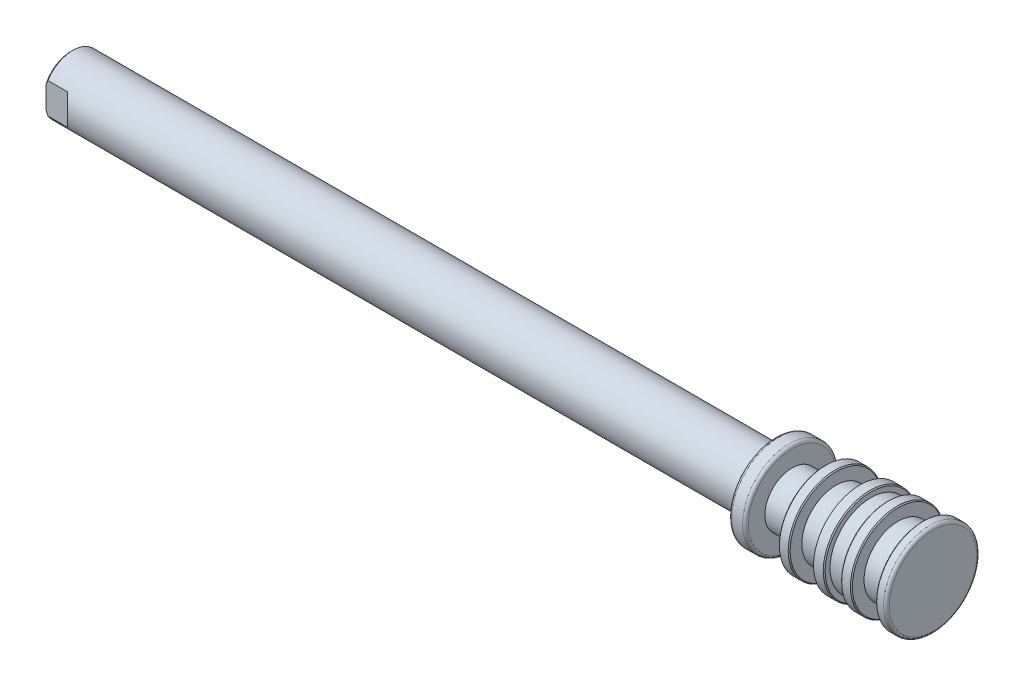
ISO-10303-21;
HEADER;
FILE_DESCRIPTION(('STEP AP214'),'2;1');
FILE_NAME('part.step','',(''),(''),'','','');
FILE_SCHEMA(('AUTOMOTIVE_DESIGN { 1 0 10303 214 1 1 1 1 }'));
ENDSEC;
DATA;
#1=APPLICATION_CONTEXT('core data for automotive mechanical design processes');
#2=APPLICATION_PROTOCOL_DEFINITION('international standard','automotive_design',2000,#1);
#3=PRODUCT_CONTEXT('',#1,'mechanical');
#4=PRODUCT('Part','Part','',(#3));
#5=PRODUCT_RELATED_PRODUCT_CATEGORY('part','',(#4));
#6=PRODUCT_DEFINITION_FORMATION('','',#4);
#7=PRODUCT_DEFINITION_CONTEXT('part definition',#1,'design');
#8=PRODUCT_DEFINITION('design','',#6,#7);
#9=PRODUCT_DEFINITION_SHAPE('','',#8);
#10=(LENGTH_UNIT() NAMED_UNIT(*) SI_UNIT(.MILLI.,.METRE.));
#11=(NAMED_UNIT(*) PLANE_ANGLE_UNIT() SI_UNIT($,.RADIAN.));
#12=(NAMED_UNIT(*) SI_UNIT($,.STERADIAN.) SOLID_ANGLE_UNIT());
#13=UNCERTAINTY_MEASURE_WITH_UNIT(LENGTH_MEASURE(1.E-05),#10,'distance_accuracy_value','');
#14=(GEOMETRIC_REPRESENTATION_CONTEXT(3) GLOBAL_UNCERTAINTY_ASSIGNED_CONTEXT((#13)) GLOBAL_UNIT_ASSIGNED_CONTEXT((#10,
#11,#12)) REPRESENTATION_CONTEXT('',''));
#15=CARTESIAN_POINT('',(0.,0.,0.));
#16=DIRECTION('',(0.,0.,1.));
#17=DIRECTION('',(1.,0.,0.));
#18=AXIS2_PLACEMENT_3D('',#15,#16,#17);
#19=CARTESIAN_POINT('',(88.7,4.5,0.));
#20=DIRECTION('',(-1.,0.,0.));
#21=DIRECTION('',(0.,0.,1.));
#22=AXIS2_PLACEMENT_3D('',#19,#20,#21);
#23=PLANE('',#22);
#24=CARTESIAN_POINT('',(88.7,0.,0.));
#25=DIRECTION('',(-1.,0.,0.));
#26=DIRECTION('',(0.,0.,-1.));
#27=AXIS2_PLACEMENT_3D('',#24,#25,#26);
#28=CIRCLE('',#27,4.5);
#29=CARTESIAN_POINT('',(88.7,0.,-4.5));
#30=VERTEX_POINT('',#29);
#31=CARTESIAN_POINT('',(88.7,0.,4.5));
#32=VERTEX_POINT('',#31);
#33=EDGE_CURVE('E288',#30,#32,#28,.T.);
#34=ORIENTED_EDGE('',*,*,#33,.F.);
#35=CARTESIAN_POINT('',(88.7,0.,0.));
#36=DIRECTION('',(-1.,0.,0.));
#37=DIRECTION('',(0.,0.,1.));
#38=AXIS2_PLACEMENT_3D('',#35,#36,#37);
#39=CIRCLE('',#38,4.5);
#40=EDGE_CURVE('E728',#32,#30,#39,.T.);
#41=ORIENTED_EDGE('',*,*,#40,.F.);
#42=EDGE_LOOP('',(#34,#41));
#43=FACE_BOUND('',#42,.T.);
#44=ADVANCED_FACE('F17',(#43),#23,.F.);
#45=CARTESIAN_POINT('',(88.4,0.,0.));
#46=DIRECTION('',(-1.,0.,0.));
#47=DIRECTION('',(0.,0.,1.));
#48=AXIS2_PLACEMENT_3D('',#45,#46,#47);
#49=TOROIDAL_SURFACE('',#48,4.50000000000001,0.299999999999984);
#50=ORIENTED_EDGE('',*,*,#40,.T.);
#51=ORIENTED_EDGE('',*,*,#33,.T.);
#52=EDGE_LOOP('',(#50,#51));
#53=FACE_BOUND('',#52,.T.);
#54=CARTESIAN_POINT('',(88.4,0.,0.));
#55=DIRECTION('',(-1.,0.,0.));
#56=DIRECTION('',(0.,0.,1.));
#57=AXIS2_PLACEMENT_3D('',#54,#55,#56);
#58=CIRCLE('',#57,4.8);
#59=CARTESIAN_POINT('',(88.4,0.,4.8));
#60=VERTEX_POINT('',#59);
#61=EDGE_CURVE('E285',#60,#60,#58,.T.);
#62=ORIENTED_EDGE('',*,*,#61,.F.);
#63=EDGE_LOOP('',(#62));
#64=FACE_BOUND('',#63,.T.);
#65=ADVANCED_FACE('F293',(#53,#64),#49,.T.);
#66=CARTESIAN_POINT('',(88.7,0.,0.));
#67=DIRECTION('',(-1.,0.,0.));
#68=DIRECTION('',(0.,0.,1.));
#69=AXIS2_PLACEMENT_3D('',#66,#67,#68);
#70=CYLINDRICAL_SURFACE('',#69,4.8);
#71=ORIENTED_EDGE('',*,*,#61,.T.);
#72=EDGE_LOOP('',(#71));
#73=FACE_BOUND('',#72,.T.);
#74=CARTESIAN_POINT('',(87.6999999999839,0.,0.));
#75=DIRECTION('',(1.,0.,0.));
#76=DIRECTION('',(0.,0.,-1.));
#77=AXIS2_PLACEMENT_3D('',#74,#75,#76);
#78=CIRCLE('',#77,4.79999999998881);
#79=CARTESIAN_POINT('',(87.6999999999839,0.,-4.79999999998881));
#80=VERTEX_POINT('',#79);
#81=EDGE_CURVE('E281',#80,#80,#78,.F.);
#82=ORIENTED_EDGE('',*,*,#81,.F.);
#83=EDGE_LOOP('',(#82));
#84=FACE_BOUND('',#83,.T.);
#85=ADVANCED_FACE('F297',(#73,#84),#70,.T.);
#86=CARTESIAN_POINT('',(87.6999999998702,0.,0.));
#87=DIRECTION('',(1.,0.,0.));
#88=DIRECTION('',(0.,0.,-1.));
#89=AXIS2_PLACEMENT_3D('',#86,#87,#88);
#90=CONICAL_SURFACE('',#89,4.79999999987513,0.785398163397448);
#91=CARTESIAN_POINT('',(87.5999999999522,0.,0.));
#92=DIRECTION('',(1.,0.,0.));
#93=DIRECTION('',(0.,0.,-1.));
#94=AXIS2_PLACEMENT_3D('',#91,#92,#93);
#95=CIRCLE('',#94,4.69999999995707);
#96=CARTESIAN_POINT('',(87.5999999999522,0.,-4.69999999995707));
#97=VERTEX_POINT('',#96);
#98=EDGE_CURVE('E284',#97,#97,#95,.T.);
#99=ORIENTED_EDGE('',*,*,#98,.T.);
#100=EDGE_LOOP('',(#99));
#101=FACE_BOUND('',#100,.T.);
#102=ORIENTED_EDGE('',*,*,#81,.T.);
#103=EDGE_LOOP('',(#102));
#104=FACE_BOUND('',#103,.T.);
#105=ADVANCED_FACE('F384',(#101,#104),#90,.T.);
#106=CARTESIAN_POINT('',(87.6,3.5,0.));
#107=DIRECTION('',(1.,0.,0.));
#108=DIRECTION('',(0.,0.,-1.));
#109=AXIS2_PLACEMENT_3D('',#106,#107,#108);
#110=PLANE('',#109);
#111=ORIENTED_EDGE('',*,*,#98,.F.);
#112=EDGE_LOOP('',(#111));
#113=FACE_BOUND('',#112,.T.);
#114=CARTESIAN_POINT('',(87.6,0.,0.));
#115=DIRECTION('',(-1.,0.,0.));
#116=DIRECTION('',(0.,0.,1.));
#117=AXIS2_PLACEMENT_3D('',#114,#115,#116);
#118=CIRCLE('',#117,3.5);
#119=CARTESIAN_POINT('',(87.6,0.,3.5));
#120=VERTEX_POINT('',#119);
#121=EDGE_CURVE('E379',#120,#120,#118,.T.);
#122=ORIENTED_EDGE('',*,*,#121,.F.);
#123=EDGE_LOOP('',(#122));
#124=FACE_BOUND('',#123,.T.);
#125=ADVANCED_FACE('F387',(#113,#124),#110,.F.);
#126=CARTESIAN_POINT('',(88.7,0.,0.));
#127=DIRECTION('',(-1.,0.,0.));
#128=DIRECTION('',(0.,0.,1.));
#129=AXIS2_PLACEMENT_3D('',#126,#127,#128);
#130=CYLINDRICAL_SURFACE('',#129,3.5);
#131=CARTESIAN_POINT('',(85.1,0.,0.));
#132=DIRECTION('',(-1.,0.,0.));
#133=DIRECTION('',(0.,0.,1.));
#134=AXIS2_PLACEMENT_3D('',#131,#132,#133);
#135=CIRCLE('',#134,3.5);
#136=CARTESIAN_POINT('',(85.1,0.,3.5));
#137=VERTEX_POINT('',#136);
#138=EDGE_CURVE('E376',#137,#137,#135,.F.);
#139=ORIENTED_EDGE('',*,*,#138,.T.);
#140=EDGE_LOOP('',(#139));
#141=FACE_BOUND('',#140,.T.);
#142=ORIENTED_EDGE('',*,*,#121,.T.);
#143=EDGE_LOOP('',(#142));
#144=FACE_BOUND('',#143,.T.);
#145=ADVANCED_FACE('F390',(#141,#144),#130,.T.);
#146=CARTESIAN_POINT('',(85.1,4.7,0.));
#147=DIRECTION('',(-1.,0.,0.));
#148=DIRECTION('',(0.,0.,1.));
#149=AXIS2_PLACEMENT_3D('',#146,#147,#148);
#150=PLANE('',#149);
#151=ORIENTED_EDGE('',*,*,#138,.F.);
#152=EDGE_LOOP('',(#151));
#153=FACE_BOUND('',#152,.T.);
#154=CARTESIAN_POINT('',(85.0999999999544,0.,0.));
#155=DIRECTION('',(-1.,0.,0.));
#156=DIRECTION('',(0.,0.,1.));
#157=AXIS2_PLACEMENT_3D('',#154,#155,#156);
#158=CIRCLE('',#157,4.70000000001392);
#159=CARTESIAN_POINT('',(85.0999999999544,0.,4.70000000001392));
#160=VERTEX_POINT('',#159);
#161=EDGE_CURVE('E280',#160,#160,#158,.T.);
#162=ORIENTED_EDGE('',*,*,#161,.F.);
#163=EDGE_LOOP('',(#162));
#164=FACE_BOUND('',#163,.T.);
#165=ADVANCED_FACE('F395',(#153,#164),#150,.F.);
#166=CARTESIAN_POINT('',(85.0000000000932,0.,0.));
#167=DIRECTION('',(-1.,0.,0.));
#168=DIRECTION('',(0.,0.,1.));
#169=AXIS2_PLACEMENT_3D('',#166,#167,#168);
#170=CONICAL_SURFACE('',#169,4.79999999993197,0.785398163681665);
#171=ORIENTED_EDGE('',*,*,#161,.T.);
#172=EDGE_LOOP('',(#171));
#173=FACE_BOUND('',#172,.T.);
#174=CARTESIAN_POINT('',(85.,0.,0.));
#175=DIRECTION('',(-1.,0.,0.));
#176=DIRECTION('',(0.,0.,1.));
#177=AXIS2_PLACEMENT_3D('',#174,#175,#176);
#178=CIRCLE('',#177,4.8);
#179=CARTESIAN_POINT('',(85.,0.,4.8));
#180=VERTEX_POINT('',#179);
#181=EDGE_CURVE('E277',#180,#180,#178,.T.);
#182=ORIENTED_EDGE('',*,*,#181,.F.);
#183=EDGE_LOOP('',(#182));
#184=FACE_BOUND('',#183,.T.);
#185=ADVANCED_FACE('F402',(#173,#184),#170,.T.);
#186=CARTESIAN_POINT('',(88.7,0.,0.));
#187=DIRECTION('',(-1.,0.,0.));
#188=DIRECTION('',(0.,0.,1.));
#189=AXIS2_PLACEMENT_3D('',#186,#187,#188);
#190=CYLINDRICAL_SURFACE('',#189,4.8);
#191=ORIENTED_EDGE('',*,*,#181,.T.);
#192=EDGE_LOOP('',(#191));
#193=FACE_BOUND('',#192,.T.);
#194=CARTESIAN_POINT('',(84.0999999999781,0.,0.));
#195=DIRECTION('',(1.,0.,0.));
#196=DIRECTION('',(0.,0.,-1.));
#197=AXIS2_PLACEMENT_3D('',#194,#195,#196);
#198=CIRCLE('',#197,4.80000000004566);
#199=CARTESIAN_POINT('',(84.0999999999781,0.,-4.80000000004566));
#200=VERTEX_POINT('',#199);
#201=EDGE_CURVE('E273',#200,#200,#198,.F.);
#202=ORIENTED_EDGE('',*,*,#201,.F.);
#203=EDGE_LOOP('',(#202));
#204=FACE_BOUND('',#203,.T.);
#205=ADVANCED_FACE('F663',(#193,#204),#190,.T.);
#206=CARTESIAN_POINT('',(84.0999999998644,0.,0.));
#207=DIRECTION('',(1.,0.,0.));
#208=DIRECTION('',(0.,0.,-1.));
#209=AXIS2_PLACEMENT_3D('',#206,#207,#208);
#210=CONICAL_SURFACE('',#209,4.79999999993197,0.785398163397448);
#211=CARTESIAN_POINT('',(84.0000000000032,0.,0.));
#212=DIRECTION('',(1.,0.,0.));
#213=DIRECTION('',(0.,0.,-1.));
#214=AXIS2_PLACEMENT_3D('',#211,#212,#213);
#215=CIRCLE('',#214,4.70000000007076);
#216=CARTESIAN_POINT('',(84.0000000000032,0.,-4.70000000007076));
#217=VERTEX_POINT('',#216);
#218=EDGE_CURVE('E276',#217,#217,#215,.T.);
#219=ORIENTED_EDGE('',*,*,#218,.T.);
#220=EDGE_LOOP('',(#219));
#221=FACE_BOUND('',#220,.T.);
#222=ORIENTED_EDGE('',*,*,#201,.T.);
#223=EDGE_LOOP('',(#222));
#224=FACE_BOUND('',#223,.T.);
#225=ADVANCED_FACE('F654',(#221,#224),#210,.T.);
#226=CARTESIAN_POINT('',(84.,4.2,0.));
#227=DIRECTION('',(1.,0.,0.));
#228=DIRECTION('',(0.,0.,-1.));
#229=AXIS2_PLACEMENT_3D('',#226,#227,#228);
#230=PLANE('',#229);
#231=ORIENTED_EDGE('',*,*,#218,.F.);
#232=EDGE_LOOP('',(#231));
#233=FACE_BOUND('',#232,.T.);
#234=CARTESIAN_POINT('',(84.,0.,0.));
#235=DIRECTION('',(-1.,0.,0.));
#236=DIRECTION('',(0.,0.,1.));
#237=AXIS2_PLACEMENT_3D('',#234,#235,#236);
#238=CIRCLE('',#237,4.2);
#239=CARTESIAN_POINT('',(84.,0.,4.2));
#240=VERTEX_POINT('',#239);
#241=EDGE_CURVE('E369',#240,#240,#238,.T.);
#242=ORIENTED_EDGE('',*,*,#241,.F.);
#243=EDGE_LOOP('',(#242));
#244=FACE_BOUND('',#243,.T.);
#245=ADVANCED_FACE('F645',(#233,#244),#230,.F.);
#246=CARTESIAN_POINT('',(88.7,0.,0.));
#247=DIRECTION('',(-1.,0.,0.));
#248=DIRECTION('',(0.,0.,1.));
#249=AXIS2_PLACEMENT_3D('',#246,#247,#248);
#250=CYLINDRICAL_SURFACE('',#249,4.2);
#251=CARTESIAN_POINT('',(82.3,0.,0.));
#252=DIRECTION('',(-1.,0.,0.));
#253=DIRECTION('',(0.,0.,1.));
#254=AXIS2_PLACEMENT_3D('',#251,#252,#253);
#255=CIRCLE('',#254,4.2);
#256=CARTESIAN_POINT('',(82.3,0.,4.2));
#257=VERTEX_POINT('',#256);
#258=EDGE_CURVE('E366',#257,#257,#255,.F.);
#259=ORIENTED_EDGE('',*,*,#258,.T.);
#260=EDGE_LOOP('',(#259));
#261=FACE_BOUND('',#260,.T.);
#262=ORIENTED_EDGE('',*,*,#241,.T.);
#263=EDGE_LOOP('',(#262));
#264=FACE_BOUND('',#263,.T.);
#265=ADVANCED_FACE('F636',(#261,#264),#250,.T.);
#266=CARTESIAN_POINT('',(82.3,4.7,0.));
#267=DIRECTION('',(-1.,0.,0.));
#268=DIRECTION('',(0.,0.,1.));
#269=AXIS2_PLACEMENT_3D('',#266,#267,#268);
#270=PLANE('',#269);
#271=ORIENTED_EDGE('',*,*,#258,.F.);
#272=EDGE_LOOP('',(#271));
#273=FACE_BOUND('',#272,.T.);
#274=CARTESIAN_POINT('',(82.2999999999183,0.,0.));
#275=DIRECTION('',(-1.,0.,0.));
#276=DIRECTION('',(0.,0.,1.));
#277=AXIS2_PLACEMENT_3D('',#274,#275,#276);
#278=CIRCLE('',#277,4.70000000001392);
#279=CARTESIAN_POINT('',(82.2999999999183,0.,4.70000000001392));
#280=VERTEX_POINT('',#279);
#281=EDGE_CURVE('E272',#280,#280,#278,.T.);
#282=ORIENTED_EDGE('',*,*,#281,.F.);
#283=EDGE_LOOP('',(#282));
#284=FACE_BOUND('',#283,.T.);
#285=ADVANCED_FACE('F627',(#273,#284),#270,.F.);
#286=CARTESIAN_POINT('',(82.200000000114,0.,0.));
#287=DIRECTION('',(-1.,0.,0.));
#288=DIRECTION('',(0.,0.,1.));
#289=AXIS2_PLACEMENT_3D('',#286,#287,#288);
#290=CONICAL_SURFACE('',#289,4.79999999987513,0.785398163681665);
#291=CARTESIAN_POINT('',(82.2,0.,0.));
#292=DIRECTION('',(-1.,0.,0.));
#293=DIRECTION('',(0.,0.,1.));
#294=AXIS2_PLACEMENT_3D('',#291,#292,#293);
#295=CIRCLE('',#294,4.8);
#296=CARTESIAN_POINT('',(82.2,0.,4.8));
#297=VERTEX_POINT('',#296);
#298=EDGE_CURVE('E268',#297,#297,#295,.T.);
#299=ORIENTED_EDGE('',*,*,#298,.F.);
#300=EDGE_LOOP('',(#299));
#301=FACE_BOUND('',#300,.T.);
#302=ORIENTED_EDGE('',*,*,#281,.T.);
#303=EDGE_LOOP('',(#302));
#304=FACE_BOUND('',#303,.T.);
#305=ADVANCED_FACE('F618',(#301,#304),#290,.T.);
#306=CARTESIAN_POINT('',(88.7,0.,0.));
#307=DIRECTION('',(-1.,0.,0.));
#308=DIRECTION('',(0.,0.,1.));
#309=AXIS2_PLACEMENT_3D('',#306,#307,#308);
#310=CYLINDRICAL_SURFACE('',#309,4.8);
#311=CARTESIAN_POINT('',(81.2,0.,0.));
#312=DIRECTION('',(-1.,0.,0.));
#313=DIRECTION('',(0.,0.,1.));
#314=AXIS2_PLACEMENT_3D('',#311,#312,#313);
#315=CIRCLE('',#314,4.8);
#316=CARTESIAN_POINT('',(81.2,0.,4.8));
#317=VERTEX_POINT('',#316);
#318=EDGE_CURVE('E271',#317,#317,#315,.F.);
#319=ORIENTED_EDGE('',*,*,#318,.T.);
#320=EDGE_LOOP('',(#319));
#321=FACE_BOUND('',#320,.T.);
#322=ORIENTED_EDGE('',*,*,#298,.T.);
#323=EDGE_LOOP('',(#322));
#324=FACE_BOUND('',#323,.T.);
#325=ADVANCED_FACE('F609',(#321,#324),#310,.T.);
#326=CARTESIAN_POINT('',(81.2,3.5,0.));
#327=DIRECTION('',(1.,0.,0.));
#328=DIRECTION('',(0.,0.,-1.));
#329=AXIS2_PLACEMENT_3D('',#326,#327,#328);
#330=PLANE('',#329);
#331=ORIENTED_EDGE('',*,*,#318,.F.);
#332=EDGE_LOOP('',(#331));
#333=FACE_BOUND('',#332,.T.);
#334=CARTESIAN_POINT('',(81.2,0.,0.));
#335=DIRECTION('',(-1.,0.,0.));
#336=DIRECTION('',(0.,0.,1.));
#337=AXIS2_PLACEMENT_3D('',#334,#335,#336);
#338=CIRCLE('',#337,3.5);
#339=CARTESIAN_POINT('',(81.2,0.,3.5));
#340=VERTEX_POINT('',#339);
#341=EDGE_CURVE('E359',#340,#340,#338,.T.);
#342=ORIENTED_EDGE('',*,*,#341,.F.);
#343=EDGE_LOOP('',(#342));
#344=FACE_BOUND('',#343,.T.);
#345=ADVANCED_FACE('F600',(#333,#344),#330,.F.);
#346=CARTESIAN_POINT('',(88.7,0.,0.));
#347=DIRECTION('',(-1.,0.,0.));
#348=DIRECTION('',(0.,0.,1.));
#349=AXIS2_PLACEMENT_3D('',#346,#347,#348);
#350=CYLINDRICAL_SURFACE('',#349,3.5);
#351=CARTESIAN_POINT('',(78.7,0.,0.));
#352=DIRECTION('',(-1.,0.,0.));
#353=DIRECTION('',(0.,0.,1.));
#354=AXIS2_PLACEMENT_3D('',#351,#352,#353);
#355=CIRCLE('',#354,3.5);
#356=CARTESIAN_POINT('',(78.7,0.,3.5));
#357=VERTEX_POINT('',#356);
#358=EDGE_CURVE('E356',#357,#357,#355,.F.);
#359=ORIENTED_EDGE('',*,*,#358,.T.);
#360=EDGE_LOOP('',(#359));
#361=FACE_BOUND('',#360,.T.);
#362=ORIENTED_EDGE('',*,*,#341,.T.);
#363=EDGE_LOOP('',(#362));
#364=FACE_BOUND('',#363,.T.);
#365=ADVANCED_FACE('F591',(#361,#364),#350,.T.);
#366=CARTESIAN_POINT('',(78.7,4.7,0.));
#367=DIRECTION('',(-1.,0.,0.));
#368=DIRECTION('',(0.,0.,1.));
#369=AXIS2_PLACEMENT_3D('',#366,#367,#368);
#370=PLANE('',#369);
#371=ORIENTED_EDGE('',*,*,#358,.F.);
#372=EDGE_LOOP('',(#371));
#373=FACE_BOUND('',#372,.T.);
#374=CARTESIAN_POINT('',(78.6999999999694,0.,0.));
#375=DIRECTION('',(-1.,0.,0.));
#376=DIRECTION('',(0.,0.,1.));
#377=AXIS2_PLACEMENT_3D('',#374,#375,#376);
#378=CIRCLE('',#377,4.70000000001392);
#379=CARTESIAN_POINT('',(78.6999999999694,0.,4.70000000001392));
#380=VERTEX_POINT('',#379);
#381=EDGE_CURVE('E267',#380,#380,#378,.T.);
#382=ORIENTED_EDGE('',*,*,#381,.F.);
#383=EDGE_LOOP('',(#382));
#384=FACE_BOUND('',#383,.T.);
#385=ADVANCED_FACE('F582',(#373,#384),#370,.F.);
#386=CARTESIAN_POINT('',(78.6000000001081,0.,0.));
#387=DIRECTION('',(-1.,0.,0.));
#388=DIRECTION('',(0.,0.,1.));
#389=AXIS2_PLACEMENT_3D('',#386,#387,#388);
#390=CONICAL_SURFACE('',#389,4.79999999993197,0.785398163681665);
#391=ORIENTED_EDGE('',*,*,#381,.T.);
#392=EDGE_LOOP('',(#391));
#393=FACE_BOUND('',#392,.T.);
#394=CARTESIAN_POINT('',(78.6000000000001,0.,0.));
#395=DIRECTION('',(-1.,0.,0.));
#396=DIRECTION('',(0.,0.,1.));
#397=AXIS2_PLACEMENT_3D('',#394,#395,#396);
#398=CIRCLE('',#397,4.8);
#399=CARTESIAN_POINT('',(78.6000000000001,0.,4.8));
#400=VERTEX_POINT('',#399);
#401=EDGE_CURVE('E264',#400,#400,#398,.T.);
#402=ORIENTED_EDGE('',*,*,#401,.F.);
#403=EDGE_LOOP('',(#402));
#404=FACE_BOUND('',#403,.T.);
#405=ADVANCED_FACE('F573',(#393,#404),#390,.T.);
#406=CARTESIAN_POINT('',(88.7,0.,0.));
#407=DIRECTION('',(-1.,0.,0.));
#408=DIRECTION('',(0.,0.,1.));
#409=AXIS2_PLACEMENT_3D('',#406,#407,#408);
#410=CYLINDRICAL_SURFACE('',#409,4.8);
#411=ORIENTED_EDGE('',*,*,#401,.T.);
#412=EDGE_LOOP('',(#411));
#413=FACE_BOUND('',#412,.T.);
#414=CARTESIAN_POINT('',(77.699999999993,0.,0.));
#415=DIRECTION('',(1.,0.,0.));
#416=DIRECTION('',(0.,0.,-1.));
#417=AXIS2_PLACEMENT_3D('',#414,#415,#416);
#418=CIRCLE('',#417,4.79999999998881);
#419=CARTESIAN_POINT('',(77.699999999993,0.,-4.79999999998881));
#420=VERTEX_POINT('',#419);
#421=EDGE_CURVE('E260',#420,#420,#418,.F.);
#422=ORIENTED_EDGE('',*,*,#421,.F.);
#423=EDGE_LOOP('',(#422));
#424=FACE_BOUND('',#423,.T.);
#425=ADVANCED_FACE('F564',(#413,#424),#410,.T.);
#426=CARTESIAN_POINT('',(77.6999999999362,0.,0.));
#427=DIRECTION('',(1.,0.,0.));
#428=DIRECTION('',(0.,0.,-1.));
#429=AXIS2_PLACEMENT_3D('',#426,#427,#428);
#430=CONICAL_SURFACE('',#429,4.79999999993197,0.785398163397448);
#431=CARTESIAN_POINT('',(77.5999999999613,0.,0.));
#432=DIRECTION('',(1.,0.,0.));
#433=DIRECTION('',(0.,0.,-1.));
#434=AXIS2_PLACEMENT_3D('',#431,#432,#433);
#435=CIRCLE('',#434,4.69999999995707);
#436=CARTESIAN_POINT('',(77.5999999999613,0.,-4.69999999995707));
#437=VERTEX_POINT('',#436);
#438=EDGE_CURVE('E263',#437,#437,#435,.T.);
#439=ORIENTED_EDGE('',*,*,#438,.T.);
#440=EDGE_LOOP('',(#439));
#441=FACE_BOUND('',#440,.T.);
#442=ORIENTED_EDGE('',*,*,#421,.T.);
#443=EDGE_LOOP('',(#442));
#444=FACE_BOUND('',#443,.T.);
#445=ADVANCED_FACE('F555',(#441,#444),#430,.T.);
#446=CARTESIAN_POINT('',(77.6,2.6,0.));
#447=DIRECTION('',(1.,0.,0.));
#448=DIRECTION('',(0.,0.,-1.));
#449=AXIS2_PLACEMENT_3D('',#446,#447,#448);
#450=PLANE('',#449);
#451=ORIENTED_EDGE('',*,*,#438,.F.);
#452=EDGE_LOOP('',(#451));
#453=FACE_BOUND('',#452,.T.);
#454=CARTESIAN_POINT('',(77.5999999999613,0.,0.));
#455=DIRECTION('',(-1.,0.,0.));
#456=DIRECTION('',(0.,0.,1.));
#457=AXIS2_PLACEMENT_3D('',#454,#455,#456);
#458=CIRCLE('',#457,2.60000000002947);
#459=CARTESIAN_POINT('',(77.5999999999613,0.,2.60000000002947));
#460=VERTEX_POINT('',#459);
#461=EDGE_CURVE('E259',#460,#460,#458,.T.);
#462=ORIENTED_EDGE('',*,*,#461,.F.);
#463=EDGE_LOOP('',(#462));
#464=FACE_BOUND('',#463,.T.);
#465=ADVANCED_FACE('F547',(#453,#464),#450,.F.);
#466=CARTESIAN_POINT('',(77.4000000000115,0.,0.));
#467=DIRECTION('',(-1.,0.,0.));
#468=DIRECTION('',(0.,0.,1.));
#469=AXIS2_PLACEMENT_3D('',#466,#467,#468);
#470=CONICAL_SURFACE('',#469,2.79999999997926,0.785398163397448);
#471=CARTESIAN_POINT('',(77.4,0.,0.));
#472=DIRECTION('',(-1.,0.,0.));
#473=DIRECTION('',(0.,0.,1.));
#474=AXIS2_PLACEMENT_3D('',#471,#472,#473);
#475=CIRCLE('',#474,2.8);
#476=CARTESIAN_POINT('',(77.4,0.,2.8));
#477=VERTEX_POINT('',#476);
#478=EDGE_CURVE('E250',#477,#477,#475,.T.);
#479=ORIENTED_EDGE('',*,*,#478,.F.);
#480=EDGE_LOOP('',(#479));
#481=FACE_BOUND('',#480,.T.);
#482=ORIENTED_EDGE('',*,*,#461,.T.);
#483=EDGE_LOOP('',(#482));
#484=FACE_BOUND('',#483,.T.);
#485=ADVANCED_FACE('F539',(#481,#484),#470,.T.);
#486=CARTESIAN_POINT('',(88.7,0.,0.));
#487=DIRECTION('',(-1.,0.,0.));
#488=DIRECTION('',(0.,0.,1.));
#489=AXIS2_PLACEMENT_3D('',#486,#487,#488);
#490=CYLINDRICAL_SURFACE('',#489,2.8);
#491=CARTESIAN_POINT('',(74.2,0.,0.));
#492=DIRECTION('',(-1.,0.,0.));
#493=DIRECTION('',(0.,0.,1.));
#494=AXIS2_PLACEMENT_3D('',#491,#492,#493);
#495=CIRCLE('',#494,2.8);
#496=CARTESIAN_POINT('',(74.2,0.,2.8));
#497=VERTEX_POINT('',#496);
#498=EDGE_CURVE('E258',#497,#497,#495,.F.);
#499=ORIENTED_EDGE('',*,*,#498,.T.);
#500=EDGE_LOOP('',(#499));
#501=FACE_BOUND('',#500,.T.);
#502=ORIENTED_EDGE('',*,*,#478,.T.);
#503=EDGE_LOOP('',(#502));
#504=FACE_BOUND('',#503,.T.);
#505=ADVANCED_FACE('F235',(#501,#504),#490,.T.);
#506=CARTESIAN_POINT('',(74.2,4.5,0.));
#507=DIRECTION('',(-1.,0.,0.));
#508=DIRECTION('',(0.,0.,1.));
#509=AXIS2_PLACEMENT_3D('',#506,#507,#508);
#510=PLANE('',#509);
#511=ORIENTED_EDGE('',*,*,#498,.F.);
#512=EDGE_LOOP('',(#511));
#513=FACE_BOUND('',#512,.T.);
#514=CARTESIAN_POINT('',(74.2,0.,0.));
#515=DIRECTION('',(-1.,0.,0.));
#516=DIRECTION('',(0.,0.,-1.));
#517=AXIS2_PLACEMENT_3D('',#514,#515,#516);
#518=CIRCLE('',#517,4.5);
#519=CARTESIAN_POINT('',(74.2,0.,-4.5));
#520=VERTEX_POINT('',#519);
#521=CARTESIAN_POINT('',(74.2,0.,4.5));
#522=VERTEX_POINT('',#521);
#523=EDGE_CURVE('E187',#520,#522,#518,.T.);
#524=ORIENTED_EDGE('',*,*,#523,.F.);
#525=CARTESIAN_POINT('',(74.2,0.,0.));
#526=DIRECTION('',(-1.,0.,0.));
#527=DIRECTION('',(0.,0.,1.));
#528=AXIS2_PLACEMENT_3D('',#525,#526,#527);
#529=CIRCLE('',#528,4.5);
#530=EDGE_CURVE('E217',#522,#520,#529,.T.);
#531=ORIENTED_EDGE('',*,*,#530,.F.);
#532=EDGE_LOOP('',(#524,#531));
#533=FACE_BOUND('',#532,.T.);
#534=ADVANCED_FACE('F226',(#513,#533),#510,.F.);
#535=CARTESIAN_POINT('',(6.60000000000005,0.,0.));
#536=DIRECTION('',(-1.,0.,0.));
#537=DIRECTION('',(0.,0.,1.));
#538=AXIS2_PLACEMENT_3D('',#535,#536,#537);
#539=CONICAL_SURFACE('',#538,1.22949999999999,1.0471975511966);
#540=CARTESIAN_POINT('',(7.3098521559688,0.,-1.11022302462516E-13));
#541=VERTEX_POINT('',#540);
#542=VERTEX_LOOP('',#541);
#543=FACE_BOUND('',#542,.T.);
#544=CARTESIAN_POINT('',(6.6,0.,0.));
#545=DIRECTION('',(-1.,0.,0.));
#546=DIRECTION('',(0.,0.,1.));
#547=AXIS2_PLACEMENT_3D('',#544,#545,#546);
#548=CIRCLE('',#547,1.2295);
#549=CARTESIAN_POINT('',(6.6,0.,1.2295));
#550=VERTEX_POINT('',#549);
#551=EDGE_CURVE('E214',#550,#550,#548,.T.);
#552=ORIENTED_EDGE('',*,*,#551,.T.);
#553=EDGE_LOOP('',(#552));
#554=FACE_BOUND('',#553,.T.);
#555=ADVANCED_FACE('F204',(#543,#554),#539,.F.);
#556=CARTESIAN_POINT('',(73.9,0.,0.));
#557=DIRECTION('',(-1.,0.,0.));
#558=DIRECTION('',(0.,0.,1.));
#559=AXIS2_PLACEMENT_3D('',#556,#557,#558);
#560=TOROIDAL_SURFACE('',#559,4.50000000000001,0.299999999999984);
#561=CARTESIAN_POINT('',(73.9,0.,0.));
#562=DIRECTION('',(-1.,0.,0.));
#563=DIRECTION('',(0.,0.,1.));
#564=AXIS2_PLACEMENT_3D('',#561,#562,#563);
#565=CIRCLE('',#564,4.8);
#566=CARTESIAN_POINT('',(73.9,0.,4.8));
#567=VERTEX_POINT('',#566);
#568=EDGE_CURVE('E212',#567,#567,#565,.T.);
#569=ORIENTED_EDGE('',*,*,#568,.F.);
#570=EDGE_LOOP('',(#569));
#571=FACE_BOUND('',#570,.T.);
#572=ORIENTED_EDGE('',*,*,#530,.T.);
#573=ORIENTED_EDGE('',*,*,#523,.T.);
#574=EDGE_LOOP('',(#572,#573));
#575=FACE_BOUND('',#574,.T.);
#576=ADVANCED_FACE('F192',(#571,#575),#560,.T.);
#577=CARTESIAN_POINT('',(7.30985215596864,0.,0.));
#578=DIRECTION('',(-1.,0.,0.));
#579=DIRECTION('',(0.,0.,1.));
#580=AXIS2_PLACEMENT_3D('',#577,#578,#579);
#581=CYLINDRICAL_SURFACE('',#580,1.2295);
#582=ORIENTED_EDGE('',*,*,#551,.F.);
#583=EDGE_LOOP('',(#582));
#584=FACE_BOUND('',#583,.T.);
#585=CARTESIAN_POINT('',(0.270499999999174,0.,0.));
#586=DIRECTION('',(-1.,0.,0.));
#587=DIRECTION('',(0.,0.,1.));
#588=AXIS2_PLACEMENT_3D('',#585,#586,#587);
#589=CIRCLE('',#588,1.2295000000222);
#590=CARTESIAN_POINT('',(0.270499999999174,0.,1.2295000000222));
#591=VERTEX_POINT('',#590);
#592=EDGE_CURVE('E748',#591,#591,#589,.T.);
#593=ORIENTED_EDGE('',*,*,#592,.T.);
#594=EDGE_LOOP('',(#593));
#595=FACE_BOUND('',#594,.T.);
#596=ADVANCED_FACE('F203',(#584,#595),#581,.F.);
#597=CARTESIAN_POINT('',(88.7,0.,0.));
#598=DIRECTION('',(-1.,0.,0.));
#599=DIRECTION('',(0.,0.,1.));
#600=AXIS2_PLACEMENT_3D('',#597,#598,#599);
#601=CYLINDRICAL_SURFACE('',#600,4.8);
#602=CARTESIAN_POINT('',(72.8,0.,0.));
#603=DIRECTION('',(-1.,0.,0.));
#604=DIRECTION('',(0.,0.,1.));
#605=AXIS2_PLACEMENT_3D('',#602,#603,#604);
#606=CIRCLE('',#605,4.8);
#607=CARTESIAN_POINT('',(72.8,0.,4.8));
#608=VERTEX_POINT('',#607);
#609=EDGE_CURVE('E84',#608,#608,#606,.T.);
#610=ORIENTED_EDGE('',*,*,#609,.F.);
#611=EDGE_LOOP('',(#610));
#612=FACE_BOUND('',#611,.T.);
#613=ORIENTED_EDGE('',*,*,#568,.T.);
#614=EDGE_LOOP('',(#613));
#615=FACE_BOUND('',#614,.T.);
#616=ADVANCED_FACE('F498',(#612,#615),#601,.T.);
#617=CARTESIAN_POINT('',(0.,0.,0.));
#618=DIRECTION('',(-1.,0.,0.));
#619=DIRECTION('',(0.,0.,1.));
#620=AXIS2_PLACEMENT_3D('',#617,#618,#619);
#621=CONICAL_SURFACE('',#620,1.50000000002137,0.785398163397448);
#622=ORIENTED_EDGE('',*,*,#592,.F.);
#623=EDGE_LOOP('',(#622));
#624=FACE_BOUND('',#623,.T.);
#625=CARTESIAN_POINT('',(0.,0.,0.));
#626=DIRECTION('',(-1.,0.,0.));
#627=DIRECTION('',(0.,0.,1.));
#628=AXIS2_PLACEMENT_3D('',#625,#626,#627);
#629=CIRCLE('',#628,1.50000000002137);
#630=CARTESIAN_POINT('',(0.,0.,1.50000000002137));
#631=VERTEX_POINT('',#630);
#632=EDGE_CURVE('E92',#631,#631,#629,.T.);
#633=ORIENTED_EDGE('',*,*,#632,.T.);
#634=EDGE_LOOP('',(#633));
#635=FACE_BOUND('',#634,.T.);
#636=ADVANCED_FACE('F162',(#624,#635),#621,.F.);
#637=CARTESIAN_POINT('',(72.8,0.,0.));
#638=DIRECTION('',(-1.,0.,0.));
#639=DIRECTION('',(0.,0.,1.));
#640=AXIS2_PLACEMENT_3D('',#637,#638,#639);
#641=TOROIDAL_SURFACE('',#640,4.49999999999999,0.300000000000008);
#642=CARTESIAN_POINT('',(72.5,0.,0.));
#643=DIRECTION('',(1.,0.,0.));
#644=DIRECTION('',(0.,0.,1.));
#645=AXIS2_PLACEMENT_3D('',#642,#643,#644);
#646=CIRCLE('',#645,4.5);
#647=CARTESIAN_POINT('',(72.5,0.,4.5));
#648=VERTEX_POINT('',#647);
#649=CARTESIAN_POINT('',(72.5,0.,-4.5));
#650=VERTEX_POINT('',#649);
#651=EDGE_CURVE('E123',#648,#650,#646,.T.);
#652=ORIENTED_EDGE('',*,*,#651,.T.);
#653=CARTESIAN_POINT('',(72.5,0.,0.));
#654=DIRECTION('',(1.,0.,0.));
#655=DIRECTION('',(0.,0.,-1.));
#656=AXIS2_PLACEMENT_3D('',#653,#654,#655);
#657=CIRCLE('',#656,4.5);
#658=EDGE_CURVE('E152',#650,#648,#657,.T.);
#659=ORIENTED_EDGE('',*,*,#658,.T.);
#660=EDGE_LOOP('',(#652,#659));
#661=FACE_BOUND('',#660,.T.);
#662=ORIENTED_EDGE('',*,*,#609,.T.);
#663=EDGE_LOOP('',(#662));
#664=FACE_BOUND('',#663,.T.);
#665=ADVANCED_FACE('F158',(#661,#664),#641,.T.);
#666=CARTESIAN_POINT('',(0.199999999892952,0.,0.));
#667=DIRECTION('',(1.,0.,0.));
#668=DIRECTION('',(0.,0.,-1.));
#669=AXIS2_PLACEMENT_3D('',#666,#667,#668);
#670=CONICAL_SURFACE('',#669,2.99999999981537,0.785398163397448);
#671=CARTESIAN_POINT('',(0.,0.,0.));
#672=DIRECTION('',(1.,0.,0.));
#673=DIRECTION('',(0.,0.,-1.));
#674=AXIS2_PLACEMENT_3D('',#671,#672,#673);
#675=CIRCLE('',#674,2.79999999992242);
#676=CARTESIAN_POINT('',(3.087564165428E-11,1.15650335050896,-2.55));
#677=VERTEX_POINT('',#676);
#678=CARTESIAN_POINT('',(3.08757451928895E-11,1.15650335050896,2.55));
#679=VERTEX_POINT('',#678);
#680=EDGE_CURVE('E78',#677,#679,#675,.T.);
#681=ORIENTED_EDGE('',*,*,#680,.T.);
#682=CARTESIAN_POINT('',(6.0750535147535E-11,1.15650335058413,2.55000000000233));
#683=CARTESIAN_POINT('',(0.0149206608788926,1.19262549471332,2.55000000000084));
#684=CARTESIAN_POINT('',(0.0303342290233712,1.22854163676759,2.55000000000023));
#685=CARTESIAN_POINT('',(0.0620547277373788,1.29995436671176,2.54999999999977));
#686=CARTESIAN_POINT('',(0.0783611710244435,1.33545117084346,2.54999999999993));
#687=CARTESIAN_POINT('',(0.111790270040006,1.40605456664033,2.55000000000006));
#688=CARTESIAN_POINT('',(0.128912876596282,1.44116118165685,2.55000000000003));
#689=CARTESIAN_POINT('',(0.163911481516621,1.51102087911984,2.54999999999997));
#690=CARTESIAN_POINT('',(0.181787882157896,1.545773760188,2.54999999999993));
#691=CARTESIAN_POINT('',(0.20000000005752,1.58034806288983,2.55));
#692=B_SPLINE_CURVE_WITH_KNOTS('',3,(#682,#683,#684,#685,#686,#687,#688,#689,#690,#691),
.UNSPECIFIED.,.F.,.F.,(4,2,2,2,4),(0.,0.117240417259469,0.234417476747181,0.351587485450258,
0.46882083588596),.UNSPECIFIED.);
#693=CARTESIAN_POINT('',(0.200000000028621,1.5803480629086,2.55));
#694=VERTEX_POINT('',#693);
#695=EDGE_CURVE('E83',#679,#694,#692,.T.);
#696=ORIENTED_EDGE('',*,*,#695,.T.);
#697=CARTESIAN_POINT('',(0.200000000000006,0.,0.));
#698=DIRECTION('',(-1.,0.,0.));
#699=DIRECTION('',(0.,0.,1.));
#700=AXIS2_PLACEMENT_3D('',#697,#698,#699);
#701=CIRCLE('',#700,3.);
#702=CARTESIAN_POINT('',(0.200000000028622,1.5803480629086,-2.55));
#703=VERTEX_POINT('',#702);
#704=EDGE_CURVE('E81',#703,#694,#701,.F.);
#705=ORIENTED_EDGE('',*,*,#704,.F.);
#706=CARTESIAN_POINT('',(0.200000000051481,1.58034806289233,-2.55000000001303));
#707=CARTESIAN_POINT('',(0.181787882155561,1.54577376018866,-2.5500000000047));
#708=CARTESIAN_POINT('',(0.163911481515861,1.51102087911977,-2.55000000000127));
#709=CARTESIAN_POINT('',(0.128912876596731,1.4411611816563,-2.54999999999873));
#710=CARTESIAN_POINT('',(0.111790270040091,1.40605456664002,-2.54999999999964));
#711=CARTESIAN_POINT('',(0.0783611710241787,1.33545117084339,-2.55000000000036));
#712=CARTESIAN_POINT('',(0.0620547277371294,1.29995436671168,-2.55000000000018));
#713=CARTESIAN_POINT('',(0.0303342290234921,1.22854163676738,-2.54999999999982));
#714=CARTESIAN_POINT('',(0.0149206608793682,1.19262549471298,-2.54999999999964));
#715=CARTESIAN_POINT('',(6.17121312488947E-11,1.15650335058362,-2.55));
#716=B_SPLINE_CURVE_WITH_KNOTS('',3,(#706,#707,#708,#709,#710,#711,#712,#713,#714,#715),
.UNSPECIFIED.,.F.,.F.,(4,2,2,2,4),(0.,0.117233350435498,0.234403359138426,0.351580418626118,
0.468820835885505),.UNSPECIFIED.);
#717=EDGE_CURVE('E72',#703,#677,#716,.T.);
#718=ORIENTED_EDGE('',*,*,#717,.T.);
#719=EDGE_LOOP('',(#681,#696,#705,#718));
#720=FACE_BOUND('',#719,.T.);
#721=ADVANCED_FACE('F77',(#720),#670,.T.);
#722=CARTESIAN_POINT('',(0.,0.,0.));
#723=DIRECTION('',(1.,0.,0.));
#724=DIRECTION('',(0.,0.,-1.));
#725=AXIS2_PLACEMENT_3D('',#722,#723,#724);
#726=PLANE('',#725);
#727=ORIENTED_EDGE('',*,*,#632,.F.);
#728=EDGE_LOOP('',(#727));
#729=FACE_BOUND('',#728,.T.);
#730=DIRECTION('',(0.,1.,0.));
#731=VECTOR('',#730,1.);
#732=CARTESIAN_POINT('',(0.,-6.,-2.55));
#733=LINE('',#732,#731);
#734=CARTESIAN_POINT('',(0.,-1.15650335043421,-2.55));
#735=VERTEX_POINT('',#734);
#736=EDGE_CURVE('E88',#677,#735,#733,.F.);
#737=ORIENTED_EDGE('',*,*,#736,.T.);
#738=CARTESIAN_POINT('',(0.,0.,0.));
#739=DIRECTION('',(1.,0.,0.));
#740=DIRECTION('',(0.,0.,-1.));
#741=AXIS2_PLACEMENT_3D('',#738,#739,#740);
#742=CIRCLE('',#741,2.79999999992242);
#743=CARTESIAN_POINT('',(0.,-1.15650335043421,2.55));
#744=VERTEX_POINT('',#743);
#745=EDGE_CURVE('E102',#744,#735,#742,.T.);
#746=ORIENTED_EDGE('',*,*,#745,.F.);
#747=DIRECTION('',(0.,1.,0.));
#748=VECTOR('',#747,1.);
#749=CARTESIAN_POINT('',(0.,-6.,2.55));
#750=LINE('',#749,#748);
#751=EDGE_CURVE('E91',#744,#679,#750,.T.);
#752=ORIENTED_EDGE('',*,*,#751,.T.);
#753=ORIENTED_EDGE('',*,*,#680,.F.);
#754=EDGE_LOOP('',(#737,#746,#752,#753));
#755=FACE_BOUND('',#754,.T.);
#756=ADVANCED_FACE('F87',(#729,#755),#726,.F.);
#757=CARTESIAN_POINT('',(72.5,3.,0.));
#758=DIRECTION('',(1.,0.,0.));
#759=DIRECTION('',(0.,0.,-1.));
#760=AXIS2_PLACEMENT_3D('',#757,#758,#759);
#761=PLANE('',#760);
#762=ORIENTED_EDGE('',*,*,#651,.F.);
#763=ORIENTED_EDGE('',*,*,#658,.F.);
#764=EDGE_LOOP('',(#762,#763));
#765=FACE_BOUND('',#764,.T.);
#766=CARTESIAN_POINT('',(72.5,0.,0.));
#767=DIRECTION('',(-1.,0.,0.));
#768=DIRECTION('',(0.,0.,1.));
#769=AXIS2_PLACEMENT_3D('',#766,#767,#768);
#770=CIRCLE('',#769,3.);
#771=CARTESIAN_POINT('',(72.5,0.,3.));
#772=VERTEX_POINT('',#771);
#773=EDGE_CURVE('E316',#772,#772,#770,.T.);
#774=ORIENTED_EDGE('',*,*,#773,.F.);
#775=EDGE_LOOP('',(#774));
#776=FACE_BOUND('',#775,.T.);
#777=ADVANCED_FACE('F129',(#765,#776),#761,.F.);
#778=CARTESIAN_POINT('',(9.27106781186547,-6.,9.62106781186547));
#779=DIRECTION('',(0.707106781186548,0.,-0.707106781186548));
#780=DIRECTION('',(-0.707106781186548,0.,-0.707106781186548));
#781=AXIS2_PLACEMENT_3D('',#778,#779,#780);
#782=PLANE('',#781);
#783=CARTESIAN_POINT('',(-0.350000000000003,0.,0.));
#784=DIRECTION('',(0.707106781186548,0.,-0.707106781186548));
#785=DIRECTION('',(-0.707106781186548,0.,-0.707106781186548));
#786=AXIS2_PLACEMENT_3D('',#783,#784,#785);
#787=ELLIPSE('',#786,4.24264068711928,3.);
#788=CARTESIAN_POINT('',(2.2,1.58034806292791,2.55));
#789=VERTEX_POINT('',#788);
#790=CARTESIAN_POINT('',(2.2,-1.58034806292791,2.55));
#791=VERTEX_POINT('',#790);
#792=EDGE_CURVE('E313',#789,#791,#787,.T.);
#793=ORIENTED_EDGE('',*,*,#792,.F.);
#794=DIRECTION('',(0.,1.,0.));
#795=VECTOR('',#794,1.);
#796=CARTESIAN_POINT('',(2.2,-6.,2.55));
#797=LINE('',#796,#795);
#798=EDGE_CURVE('E114',#789,#791,#797,.F.);
#799=ORIENTED_EDGE('',*,*,#798,.T.);
#800=EDGE_LOOP('',(#793,#799));
#801=FACE_BOUND('',#800,.T.);
#802=ADVANCED_FACE('F139',(#801),#782,.F.);
#803=CARTESIAN_POINT('',(2.2,-6.,2.55));
#804=DIRECTION('',(0.,0.,-1.));
#805=DIRECTION('',(-1.,0.,0.));
#806=AXIS2_PLACEMENT_3D('',#803,#804,#805);
#807=PLANE('',#806);
#808=ORIENTED_EDGE('',*,*,#798,.F.);
#809=DIRECTION('',(-1.,0.,0.));
#810=VECTOR('',#809,1.);
#811=CARTESIAN_POINT('',(2.2,1.58034806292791,2.55));
#812=LINE('',#811,#810);
#813=EDGE_CURVE('E111',#694,#789,#812,.F.);
#814=ORIENTED_EDGE('',*,*,#813,.F.);
#815=ORIENTED_EDGE('',*,*,#695,.F.);
#816=ORIENTED_EDGE('',*,*,#751,.F.);
#817=CARTESIAN_POINT('',(0.200000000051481,-1.58034806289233,2.55000000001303));
#818=CARTESIAN_POINT('',(0.181787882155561,-1.54577376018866,2.55000000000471));
#819=CARTESIAN_POINT('',(0.163911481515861,-1.51102087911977,2.55000000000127));
#820=CARTESIAN_POINT('',(0.128912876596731,-1.4411611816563,2.54999999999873));
#821=CARTESIAN_POINT('',(0.11179027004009,-1.40605456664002,2.54999999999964));
#822=CARTESIAN_POINT('',(0.0783611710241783,-1.33545117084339,2.55000000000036));
#823=CARTESIAN_POINT('',(0.0620547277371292,-1.29995436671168,2.55000000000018));
#824=CARTESIAN_POINT('',(0.0303342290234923,-1.22854163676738,2.54999999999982));
#825=CARTESIAN_POINT('',(0.0149206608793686,-1.19262549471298,2.54999999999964));
#826=CARTESIAN_POINT('',(6.17125114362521E-11,-1.15650335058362,2.55));
#827=B_SPLINE_CURVE_WITH_KNOTS('',3,(#817,#818,#819,#820,#821,#822,#823,#824,#825,#826),
.UNSPECIFIED.,.F.,.F.,(4,2,2,2,4),(0.,0.117233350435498,0.234403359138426,0.351580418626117,
0.468820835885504),.UNSPECIFIED.);
#828=CARTESIAN_POINT('',(0.200000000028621,-1.5803480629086,2.55));
#829=VERTEX_POINT('',#828);
#830=EDGE_CURVE('E97',#829,#744,#827,.T.);
#831=ORIENTED_EDGE('',*,*,#830,.F.);
#832=DIRECTION('',(-1.,0.,0.));
#833=VECTOR('',#832,1.);
#834=CARTESIAN_POINT('',(88.7,-1.58034806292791,2.55));
#835=LINE('',#834,#833);
#836=EDGE_CURVE('E110',#791,#829,#835,.T.);
#837=ORIENTED_EDGE('',*,*,#836,.F.);
#838=EDGE_LOOP('',(#808,#814,#815,#816,#831,#837));
#839=FACE_BOUND('',#838,.T.);
#840=ADVANCED_FACE('F332',(#839),#807,.F.);
#841=CARTESIAN_POINT('',(0.199999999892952,0.,0.));
#842=DIRECTION('',(1.,0.,0.));
#843=DIRECTION('',(0.,0.,-1.));
#844=AXIS2_PLACEMENT_3D('',#841,#842,#843);
#845=CONICAL_SURFACE('',#844,2.99999999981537,0.785398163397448);
#846=CARTESIAN_POINT('',(0.200000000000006,0.,0.));
#847=DIRECTION('',(-1.,0.,0.));
#848=DIRECTION('',(0.,0.,1.));
#849=AXIS2_PLACEMENT_3D('',#846,#847,#848);
#850=CIRCLE('',#849,3.);
#851=CARTESIAN_POINT('',(0.200000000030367,-1.58034806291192,-2.55));
#852=VERTEX_POINT('',#851);
#853=EDGE_CURVE('E107',#829,#852,#850,.F.);
#854=ORIENTED_EDGE('',*,*,#853,.F.);
#855=ORIENTED_EDGE('',*,*,#830,.T.);
#856=ORIENTED_EDGE('',*,*,#745,.T.);
#857=CARTESIAN_POINT('',(6.14924481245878E-11,-1.15650335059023,-2.55000000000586));
#858=CARTESIAN_POINT('',(0.0149206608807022,-1.19262549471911,-2.55000000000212));
#859=CARTESIAN_POINT('',(0.0303342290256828,-1.22854163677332,-2.55000000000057));
#860=CARTESIAN_POINT('',(0.0620547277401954,-1.29995436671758,-2.54999999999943));
#861=CARTESIAN_POINT('',(0.0783611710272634,-1.33545117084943,-2.54999999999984));
#862=CARTESIAN_POINT('',(0.111790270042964,-1.40605456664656,-2.55000000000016));
#863=CARTESIAN_POINT('',(0.128912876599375,-1.44116118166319,-2.55000000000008));
#864=CARTESIAN_POINT('',(0.163911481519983,-1.51102087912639,-2.54999999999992));
#865=CARTESIAN_POINT('',(0.181787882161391,-1.54577376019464,-2.54999999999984));
#866=CARTESIAN_POINT('',(0.200000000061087,-1.5803480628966,-2.55));
#867=B_SPLINE_CURVE_WITH_KNOTS('',3,(#857,#858,#859,#860,#861,#862,#863,#864,#865,#866),
.UNSPECIFIED.,.F.,.F.,(4,2,2,2,4),(0.,0.117240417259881,0.234417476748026,0.351587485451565,
0.468820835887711),.UNSPECIFIED.);
#868=EDGE_CURVE('E96',#735,#852,#867,.T.);
#869=ORIENTED_EDGE('',*,*,#868,.T.);
#870=EDGE_LOOP('',(#854,#855,#856,#869));
#871=FACE_BOUND('',#870,.T.);
#872=ADVANCED_FACE('F329',(#871),#845,.T.);
#873=CARTESIAN_POINT('',(0.,-6.,-2.55));
#874=DIRECTION('',(0.,0.,1.));
#875=DIRECTION('',(1.,0.,0.));
#876=AXIS2_PLACEMENT_3D('',#873,#874,#875);
#877=PLANE('',#876);
#878=DIRECTION('',(0.,1.,0.));
#879=VECTOR('',#878,1.);
#880=CARTESIAN_POINT('',(2.2,-6.,-2.55));
#881=LINE('',#880,#879);
#882=CARTESIAN_POINT('',(2.2,1.58034806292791,-2.55));
#883=VERTEX_POINT('',#882);
#884=CARTESIAN_POINT('',(2.2,-1.58034806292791,-2.55));
#885=VERTEX_POINT('',#884);
#886=EDGE_CURVE('E37',#883,#885,#881,.F.);
#887=ORIENTED_EDGE('',*,*,#886,.T.);
#888=DIRECTION('',(-1.,0.,0.));
#889=VECTOR('',#888,1.);
#890=CARTESIAN_POINT('',(88.7,-1.58034806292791,-2.55));
#891=LINE('',#890,#889);
#892=EDGE_CURVE('E28',#852,#885,#891,.F.);
#893=ORIENTED_EDGE('',*,*,#892,.F.);
#894=ORIENTED_EDGE('',*,*,#868,.F.);
#895=ORIENTED_EDGE('',*,*,#736,.F.);
#896=ORIENTED_EDGE('',*,*,#717,.F.);
#897=DIRECTION('',(1.,0.,0.));
#898=VECTOR('',#897,1.);
#899=CARTESIAN_POINT('',(0.,1.58034806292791,-2.55));
#900=LINE('',#899,#898);
#901=EDGE_CURVE('E99',#883,#703,#900,.F.);
#902=ORIENTED_EDGE('',*,*,#901,.F.);
#903=EDGE_LOOP('',(#887,#893,#894,#895,#896,#902));
#904=FACE_BOUND('',#903,.T.);
#905=ADVANCED_FACE('F95',(#904),#877,.F.);
#906=CARTESIAN_POINT('',(2.2,-6.,-2.55));
#907=DIRECTION('',(0.707106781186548,0.,0.707106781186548));
#908=DIRECTION('',(0.707106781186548,0.,-0.707106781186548));
#909=AXIS2_PLACEMENT_3D('',#906,#907,#908);
#910=PLANE('',#909);
#911=ORIENTED_EDGE('',*,*,#886,.F.);
#912=CARTESIAN_POINT('',(-0.350000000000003,0.,0.));
#913=DIRECTION('',(0.707106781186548,0.,0.707106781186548));
#914=DIRECTION('',(-0.707106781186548,0.,0.707106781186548));
#915=AXIS2_PLACEMENT_3D('',#912,#913,#914);
#916=ELLIPSE('',#915,4.24264068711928,3.);
#917=EDGE_CURVE('E11',#885,#883,#916,.T.);
#918=ORIENTED_EDGE('',*,*,#917,.F.);
#919=EDGE_LOOP('',(#911,#918));
#920=FACE_BOUND('',#919,.T.);
#921=ADVANCED_FACE('F407',(#920),#910,.F.);
#922=CARTESIAN_POINT('',(88.7,0.,0.));
#923=DIRECTION('',(-1.,0.,0.));
#924=DIRECTION('',(0.,0.,1.));
#925=AXIS2_PLACEMENT_3D('',#922,#923,#924);
#926=CYLINDRICAL_SURFACE('',#925,3.);
#927=ORIENTED_EDGE('',*,*,#773,.T.);
#928=EDGE_LOOP('',(#927));
#929=FACE_BOUND('',#928,.T.);
#930=ORIENTED_EDGE('',*,*,#892,.T.);
#931=ORIENTED_EDGE('',*,*,#917,.T.);
#932=ORIENTED_EDGE('',*,*,#901,.T.);
#933=ORIENTED_EDGE('',*,*,#704,.T.);
#934=ORIENTED_EDGE('',*,*,#813,.T.);
#935=ORIENTED_EDGE('',*,*,#792,.T.);
#936=ORIENTED_EDGE('',*,*,#836,.T.);
#937=ORIENTED_EDGE('',*,*,#853,.T.);
#938=EDGE_LOOP('',(#930,#931,#932,#933,#934,#935,#936,#937));
#939=FACE_BOUND('',#938,.T.);
#940=ADVANCED_FACE('F405',(#929,#939),#926,.T.);
#941=CLOSED_SHELL('',(#44,#65,#85,#105,#125,#145,#165,#185,#205,#225,#245,#265,#285,#305,#325,
#345,#365,#385,#405,#425,#445,#465,#485,#505,#534,#555,#576,#596,#616,#636,#665,#721,#756,#777,
#802,#840,#872,#905,#921,#940));
#942=MANIFOLD_SOLID_BREP('B1',#941);
#943=ADVANCED_BREP_SHAPE_REPRESENTATION('',(#18,#942),#14);
#944=SHAPE_DEFINITION_REPRESENTATION(#9,#943);
ENDSEC;
END-ISO-10303-21;
